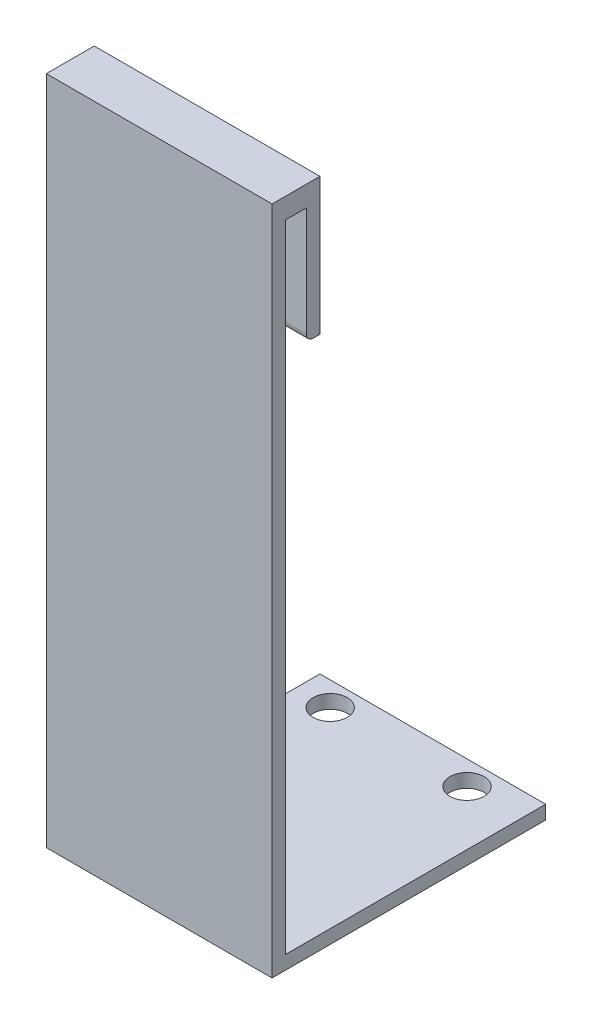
from build123d import *

# Parameters (mm, degrees)
SKETCH1_W           = 33
SKETCH1_H           = 98
BOSS_EXTRUDE1_DEPTH = 2
SKETCH2_W           = 38
SKETCH2_H           = 2
BOSS_EXTRUDE2_DEPTH = 33
BOSS_EXTRUDE4_DEPTH = 33
FILLET1_R           = 1
SKETCH5_R           = 2.5
CUT_EXTRUDE1_DEPTH  = 10
SCALE1_SCALE        = 0.8


with BuildPart() as part:
    # Sketch1 → Boss-Extrude1 (new body)
    with BuildSketch(Plane.XY):
        with Locations((-16.5, 49)):
            Rectangle(SKETCH1_W, SKETCH1_H)
    extrude(amount=BOSS_EXTRUDE1_DEPTH)

    # Sketch2 → Boss-Extrude2 (add)
    with BuildSketch(Plane(origin=(0, 0, 0), x_dir=(0, 0, -1), z_dir=(1, 0, 0))):
        with Locations((19, 1)):
            Rectangle(SKETCH2_W, SKETCH2_H)
    extrude(amount=-BOSS_EXTRUDE2_DEPTH)

    # Sketch6 → Boss-Extrude4 (add)
    with BuildSketch(Plane(origin=(0, 0, 0), x_dir=(0, 0, -1), z_dir=(1, 0, 0))):
        Polygon((0, 98), (5, 98), (5, 78), (3, 78), (3, 95), (0, 95), align=None)
    extrude(amount=-BOSS_EXTRUDE4_DEPTH)

    # Fillet1
    fillet1_edges = [part.edges().sort_by_distance(p)[0] for p in [
        (-16.5, 78, -3),
    ]]
    fillet(fillet1_edges, radius=FILLET1_R)

    # Sketch5 → Cut-Extrude1 (cut)
    with BuildSketch(Plane(origin=(0, 2, 0), x_dir=(1, 0, 0), z_dir=(0, 1, 0))):
        with Locations(Location((-28, 34.5, 0), (0, 0, 270))):
            Circle(SKETCH5_R)
        with Locations(Location((-8, 34.5, 0), (0, 0, 270))):
            Circle(SKETCH5_R)
    extrude(amount=-CUT_EXTRUDE1_DEPTH, mode=Mode.SUBTRACT)


with BuildPart() as part_1:
    # Scale1: scaled about (-16.488787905, 44.124041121, -4.20438358)
    add(part.part.scale(SCALE1_SCALE).moved(Location((-3.297757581, 8.824808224, -0.840876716))))


solid = part_1.part
